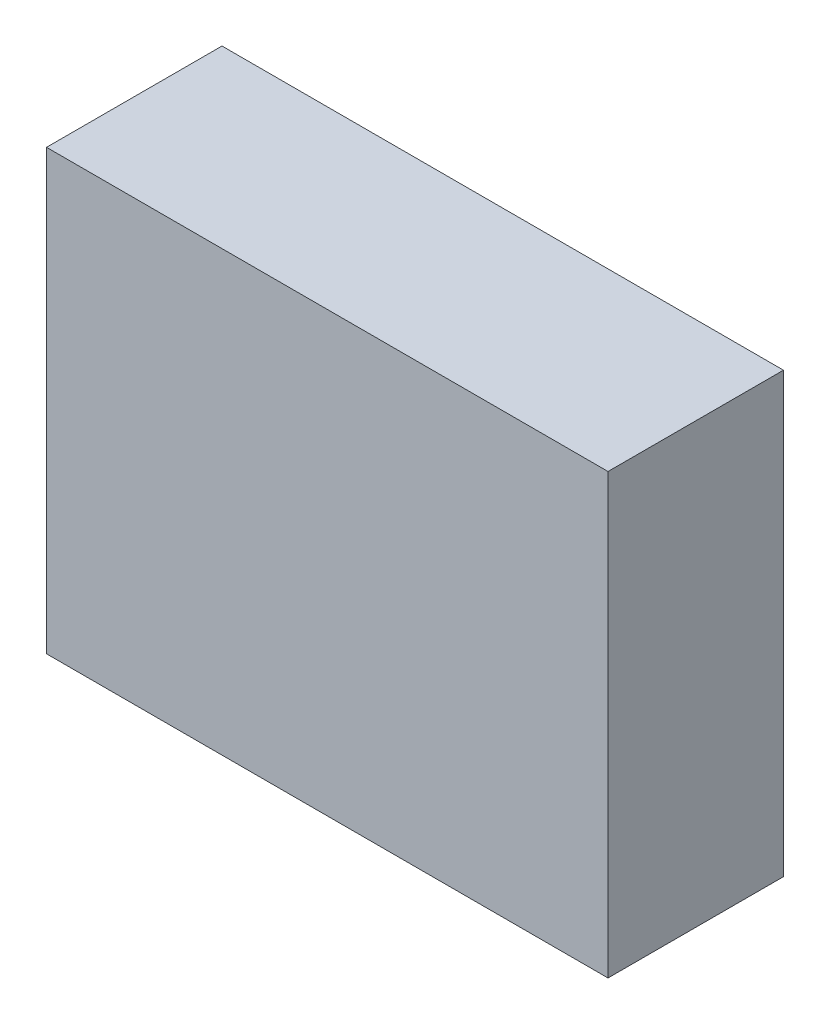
ISO-10303-21;
HEADER;
FILE_DESCRIPTION(('STEP AP214'),'2;1');
FILE_NAME('part.step','',(''),(''),'','','');
FILE_SCHEMA(('AUTOMOTIVE_DESIGN { 1 0 10303 214 1 1 1 1 }'));
ENDSEC;
DATA;
#1=APPLICATION_CONTEXT('core data for automotive mechanical design processes');
#2=APPLICATION_PROTOCOL_DEFINITION('international standard','automotive_design',2000,#1);
#3=PRODUCT_CONTEXT('',#1,'mechanical');
#4=PRODUCT('Part','Part','',(#3));
#5=PRODUCT_RELATED_PRODUCT_CATEGORY('part','',(#4));
#6=PRODUCT_DEFINITION_FORMATION('','',#4);
#7=PRODUCT_DEFINITION_CONTEXT('part definition',#1,'design');
#8=PRODUCT_DEFINITION('design','',#6,#7);
#9=PRODUCT_DEFINITION_SHAPE('','',#8);
#10=(LENGTH_UNIT() NAMED_UNIT(*) SI_UNIT(.MILLI.,.METRE.));
#11=(NAMED_UNIT(*) PLANE_ANGLE_UNIT() SI_UNIT($,.RADIAN.));
#12=(NAMED_UNIT(*) SI_UNIT($,.STERADIAN.) SOLID_ANGLE_UNIT());
#13=UNCERTAINTY_MEASURE_WITH_UNIT(LENGTH_MEASURE(1.E-05),#10,'distance_accuracy_value','');
#14=(GEOMETRIC_REPRESENTATION_CONTEXT(3) GLOBAL_UNCERTAINTY_ASSIGNED_CONTEXT((#13)) GLOBAL_UNIT_ASSIGNED_CONTEXT((#10,
#11,#12)) REPRESENTATION_CONTEXT('',''));
#15=CARTESIAN_POINT('',(0.,0.,0.));
#16=DIRECTION('',(0.,0.,1.));
#17=DIRECTION('',(1.,0.,0.));
#18=AXIS2_PLACEMENT_3D('',#15,#16,#17);
#19=CARTESIAN_POINT('',(0.,0.,1.00000054));
#20=DIRECTION('',(0.,0.,-1.));
#21=DIRECTION('',(0.,-1.,0.));
#22=AXIS2_PLACEMENT_3D('',#19,#20,#21);
#23=PLANE('',#22);
#24=DIRECTION('',(0.999999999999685,-7.9375031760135E-07,0.));
#25=VECTOR('',#24,1.);
#26=CARTESIAN_POINT('',(-1.59999934,1.25000258,1.00000054));
#27=LINE('',#26,#25);
#28=CARTESIAN_POINT('',(-1.59999934,1.25000258,1.00000054));
#29=VERTEX_POINT('',#28);
#30=CARTESIAN_POINT('',(1.59999934,1.25000004,1.00000054));
#31=VERTEX_POINT('',#30);
#32=EDGE_CURVE('E25',#29,#31,#27,.T.);
#33=ORIENTED_EDGE('',*,*,#32,.F.);
#34=DIRECTION('',(0.,1.,0.));
#35=VECTOR('',#34,1.);
#36=CARTESIAN_POINT('',(-1.59999934,-1.25000004,1.00000054));
#37=LINE('',#36,#35);
#38=CARTESIAN_POINT('',(-1.59999934,-1.25000004,1.00000054));
#39=VERTEX_POINT('',#38);
#40=EDGE_CURVE('E73',#39,#29,#37,.T.);
#41=ORIENTED_EDGE('',*,*,#40,.F.);
#42=DIRECTION('',(-0.999999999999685,7.9375033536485E-07,0.));
#43=VECTOR('',#42,1.);
#44=CARTESIAN_POINT('',(1.59999934,-1.25000258,1.00000054));
#45=LINE('',#44,#43);
#46=CARTESIAN_POINT('',(1.59999934,-1.25000258,1.00000054));
#47=VERTEX_POINT('',#46);
#48=EDGE_CURVE('E67',#47,#39,#45,.T.);
#49=ORIENTED_EDGE('',*,*,#48,.F.);
#50=DIRECTION('',(0.,-1.,0.));
#51=VECTOR('',#50,1.);
#52=CARTESIAN_POINT('',(1.59999934,1.25000004,1.00000054));
#53=LINE('',#52,#51);
#54=EDGE_CURVE('E70',#31,#47,#53,.T.);
#55=ORIENTED_EDGE('',*,*,#54,.F.);
#56=EDGE_LOOP('',(#33,#41,#49,#55));
#57=FACE_BOUND('',#56,.T.);
#58=ADVANCED_FACE('F17',(#57),#23,.F.);
#59=CARTESIAN_POINT('',(0.,0.,0.));
#60=DIRECTION('',(0.,0.,-1.));
#61=DIRECTION('',(0.,-1.,0.));
#62=AXIS2_PLACEMENT_3D('',#59,#60,#61);
#63=PLANE('',#62);
#64=DIRECTION('',(0.,-1.,0.));
#65=VECTOR('',#64,1.);
#66=CARTESIAN_POINT('',(1.59999934,1.25000004,0.));
#67=LINE('',#66,#65);
#68=CARTESIAN_POINT('',(1.59999934,1.25000004,0.));
#69=VERTEX_POINT('',#68);
#70=CARTESIAN_POINT('',(1.59999934,-1.25000258,0.));
#71=VERTEX_POINT('',#70);
#72=EDGE_CURVE('E79',#69,#71,#67,.T.);
#73=ORIENTED_EDGE('',*,*,#72,.T.);
#74=DIRECTION('',(-0.999999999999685,7.9375033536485E-07,0.));
#75=VECTOR('',#74,1.);
#76=CARTESIAN_POINT('',(1.59999934,-1.25000258,0.));
#77=LINE('',#76,#75);
#78=CARTESIAN_POINT('',(-1.59999934,-1.25000004,0.));
#79=VERTEX_POINT('',#78);
#80=EDGE_CURVE('E85',#71,#79,#77,.T.);
#81=ORIENTED_EDGE('',*,*,#80,.T.);
#82=DIRECTION('',(0.,1.,0.));
#83=VECTOR('',#82,1.);
#84=CARTESIAN_POINT('',(-1.59999934,-1.25000004,0.));
#85=LINE('',#84,#83);
#86=CARTESIAN_POINT('',(-1.59999934,1.25000258,0.));
#87=VERTEX_POINT('',#86);
#88=EDGE_CURVE('E111',#79,#87,#85,.T.);
#89=ORIENTED_EDGE('',*,*,#88,.T.);
#90=DIRECTION('',(0.999999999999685,-7.9375031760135E-07,0.));
#91=VECTOR('',#90,1.);
#92=CARTESIAN_POINT('',(-1.59999934,1.25000258,0.));
#93=LINE('',#92,#91);
#94=EDGE_CURVE('E11',#87,#69,#93,.T.);
#95=ORIENTED_EDGE('',*,*,#94,.T.);
#96=EDGE_LOOP('',(#73,#81,#89,#95));
#97=FACE_BOUND('',#96,.T.);
#98=ADVANCED_FACE('F122',(#97),#63,.T.);
#99=CARTESIAN_POINT('',(-1.59999934,1.25000258,0.));
#100=DIRECTION('',(7.9375031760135E-07,0.999999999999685,0.));
#101=DIRECTION('',(0.,0.,-1.));
#102=AXIS2_PLACEMENT_3D('',#99,#100,#101);
#103=PLANE('',#102);
#104=DIRECTION('',(0.,0.,1.));
#105=VECTOR('',#104,1.);
#106=CARTESIAN_POINT('',(-1.59999934,1.25000258,0.));
#107=LINE('',#106,#105);
#108=EDGE_CURVE('E105',#87,#29,#107,.T.);
#109=ORIENTED_EDGE('',*,*,#108,.T.);
#110=ORIENTED_EDGE('',*,*,#32,.T.);
#111=DIRECTION('',(0.,0.,1.));
#112=VECTOR('',#111,1.);
#113=CARTESIAN_POINT('',(1.59999934,1.25000004,0.));
#114=LINE('',#113,#112);
#115=EDGE_CURVE('E92',#69,#31,#114,.T.);
#116=ORIENTED_EDGE('',*,*,#115,.F.);
#117=ORIENTED_EDGE('',*,*,#94,.F.);
#118=EDGE_LOOP('',(#109,#110,#116,#117));
#119=FACE_BOUND('',#118,.T.);
#120=ADVANCED_FACE('F116',(#119),#103,.T.);
#121=CARTESIAN_POINT('',(-1.59999934,-1.25000004,0.));
#122=DIRECTION('',(-1.,0.,0.));
#123=DIRECTION('',(0.,0.,1.));
#124=AXIS2_PLACEMENT_3D('',#121,#122,#123);
#125=PLANE('',#124);
#126=DIRECTION('',(0.,0.,1.));
#127=VECTOR('',#126,1.);
#128=CARTESIAN_POINT('',(-1.59999934,-1.25000004,0.));
#129=LINE('',#128,#127);
#130=EDGE_CURVE('E78',#79,#39,#129,.T.);
#131=ORIENTED_EDGE('',*,*,#130,.T.);
#132=ORIENTED_EDGE('',*,*,#40,.T.);
#133=ORIENTED_EDGE('',*,*,#108,.F.);
#134=ORIENTED_EDGE('',*,*,#88,.F.);
#135=EDGE_LOOP('',(#131,#132,#133,#134));
#136=FACE_BOUND('',#135,.T.);
#137=ADVANCED_FACE('F120',(#136),#125,.T.);
#138=CARTESIAN_POINT('',(1.59999934,-1.25000258,0.));
#139=DIRECTION('',(-7.9375033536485E-07,-0.999999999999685,0.));
#140=DIRECTION('',(-0.999999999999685,7.9375033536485E-07,0.));
#141=AXIS2_PLACEMENT_3D('',#138,#139,#140);
#142=PLANE('',#141);
#143=DIRECTION('',(0.,0.,1.));
#144=VECTOR('',#143,1.);
#145=CARTESIAN_POINT('',(1.59999934,-1.25000258,0.));
#146=LINE('',#145,#144);
#147=EDGE_CURVE('E82',#71,#47,#146,.T.);
#148=ORIENTED_EDGE('',*,*,#147,.T.);
#149=ORIENTED_EDGE('',*,*,#48,.T.);
#150=ORIENTED_EDGE('',*,*,#130,.F.);
#151=ORIENTED_EDGE('',*,*,#80,.F.);
#152=EDGE_LOOP('',(#148,#149,#150,#151));
#153=FACE_BOUND('',#152,.T.);
#154=ADVANCED_FACE('F83',(#153),#142,.T.);
#155=CARTESIAN_POINT('',(1.59999934,1.25000004,0.));
#156=DIRECTION('',(1.,0.,0.));
#157=DIRECTION('',(0.,1.,0.));
#158=AXIS2_PLACEMENT_3D('',#155,#156,#157);
#159=PLANE('',#158);
#160=ORIENTED_EDGE('',*,*,#115,.T.);
#161=ORIENTED_EDGE('',*,*,#54,.T.);
#162=ORIENTED_EDGE('',*,*,#147,.F.);
#163=ORIENTED_EDGE('',*,*,#72,.F.);
#164=EDGE_LOOP('',(#160,#161,#162,#163));
#165=FACE_BOUND('',#164,.T.);
#166=ADVANCED_FACE('F91',(#165),#159,.T.);
#167=CLOSED_SHELL('',(#58,#98,#120,#137,#154,#166));
#168=MANIFOLD_SOLID_BREP('B1',#167);
#169=ADVANCED_BREP_SHAPE_REPRESENTATION('',(#18,#168),#14);
#170=SHAPE_DEFINITION_REPRESENTATION(#9,#169);
ENDSEC;
END-ISO-10303-21;
